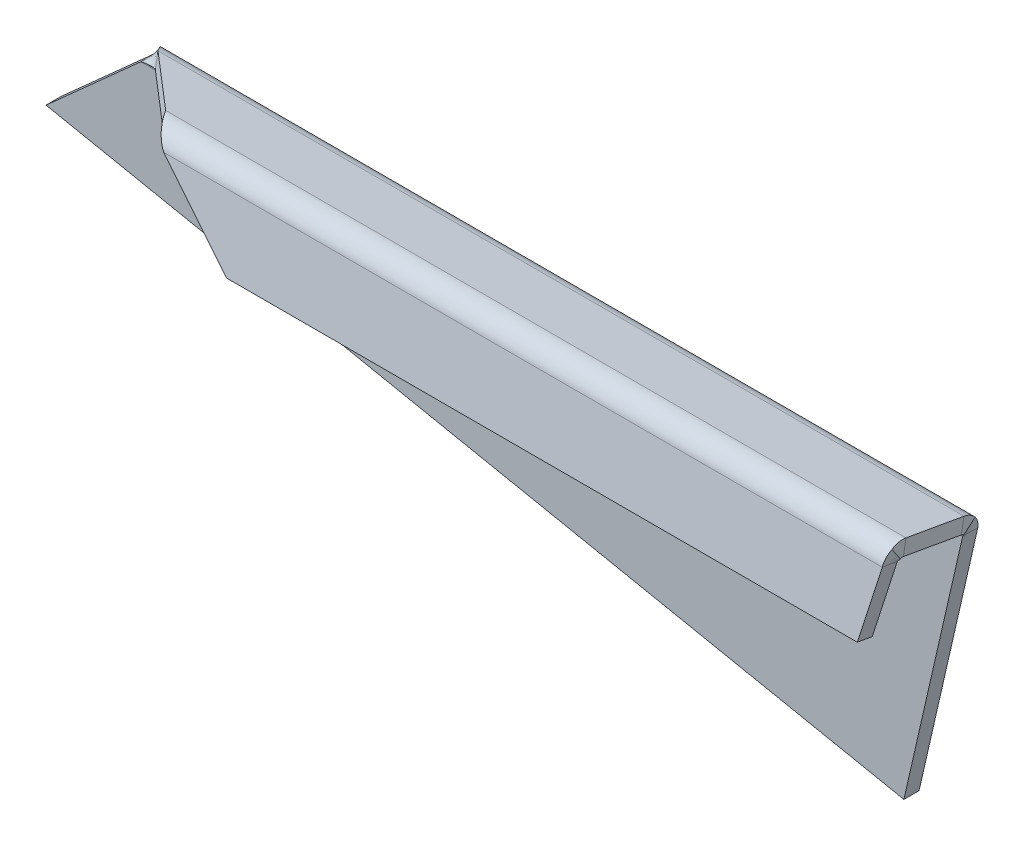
ISO-10303-21;
HEADER;
FILE_DESCRIPTION(('STEP AP214'),'2;1');
FILE_NAME('part.step','',(''),(''),'','','');
FILE_SCHEMA(('AUTOMOTIVE_DESIGN { 1 0 10303 214 1 1 1 1 }'));
ENDSEC;
DATA;
#1=APPLICATION_CONTEXT('core data for automotive mechanical design processes');
#2=APPLICATION_PROTOCOL_DEFINITION('international standard','automotive_design',2000,#1);
#3=PRODUCT_CONTEXT('',#1,'mechanical');
#4=PRODUCT('Part','Part','',(#3));
#5=PRODUCT_RELATED_PRODUCT_CATEGORY('part','',(#4));
#6=PRODUCT_DEFINITION_FORMATION('','',#4);
#7=PRODUCT_DEFINITION_CONTEXT('part definition',#1,'design');
#8=PRODUCT_DEFINITION('design','',#6,#7);
#9=PRODUCT_DEFINITION_SHAPE('','',#8);
#10=(LENGTH_UNIT() NAMED_UNIT(*) SI_UNIT(.MILLI.,.METRE.));
#11=(NAMED_UNIT(*) PLANE_ANGLE_UNIT() SI_UNIT($,.RADIAN.));
#12=(NAMED_UNIT(*) SI_UNIT($,.STERADIAN.) SOLID_ANGLE_UNIT());
#13=UNCERTAINTY_MEASURE_WITH_UNIT(LENGTH_MEASURE(1.E-05),#10,'distance_accuracy_value','');
#14=(GEOMETRIC_REPRESENTATION_CONTEXT(3) GLOBAL_UNCERTAINTY_ASSIGNED_CONTEXT((#13)) GLOBAL_UNIT_ASSIGNED_CONTEXT((#10,
#11,#12)) REPRESENTATION_CONTEXT('',''));
#15=CARTESIAN_POINT('',(0.,0.,0.));
#16=DIRECTION('',(0.,0.,1.));
#17=DIRECTION('',(1.,0.,0.));
#18=AXIS2_PLACEMENT_3D('',#15,#16,#17);
#19=CARTESIAN_POINT('',(0.,18.8237657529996,82.9229853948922));
#20=DIRECTION('',(0.,0.984807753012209,-0.173648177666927));
#21=DIRECTION('',(-1.,0.,0.));
#22=AXIS2_PLACEMENT_3D('',#19,#20,#21);
#23=PLANE('',#22);
#24=DIRECTION('',(-0.744835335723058,-0.115866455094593,-0.657111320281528));
#25=VECTOR('',#24,1.);
#26=CARTESIAN_POINT('',(-485.,-3.57684916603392,-44.1172147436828));
#27=LINE('',#26,#25);
#28=CARTESIAN_POINT('',(-390.911503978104,11.0595408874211,38.8898780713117));
#29=VERTEX_POINT('',#28);
#30=CARTESIAN_POINT('',(-425.626466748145,5.65928732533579,8.26351822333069));
#31=VERTEX_POINT('',#30);
#32=EDGE_CURVE('E94',#29,#31,#27,.T.);
#33=ORIENTED_EDGE('',*,*,#32,.F.);
#34=DIRECTION('',(1.,0.,0.));
#35=VECTOR('',#34,1.);
#36=CARTESIAN_POINT('',(0.,11.059540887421,38.8898780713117));
#37=LINE('',#36,#35);
#38=CARTESIAN_POINT('',(0.,11.059540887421,38.8898780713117));
#39=VERTEX_POINT('',#38);
#40=EDGE_CURVE('E87',#29,#39,#37,.T.);
#41=ORIENTED_EDGE('',*,*,#40,.T.);
#42=DIRECTION('',(0.,0.173648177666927,0.984807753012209));
#43=VECTOR('',#42,1.);
#44=CARTESIAN_POINT('',(0.,4.93191153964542,4.13836515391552));
#45=LINE('',#44,#43);
#46=CARTESIAN_POINT('',(0.,5.65928732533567,8.2635182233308));
#47=VERTEX_POINT('',#46);
#48=EDGE_CURVE('E102',#47,#39,#45,.T.);
#49=ORIENTED_EDGE('',*,*,#48,.F.);
#50=DIRECTION('',(1.,0.,0.));
#51=VECTOR('',#50,1.);
#52=CARTESIAN_POINT('',(0.,5.65928732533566,8.26351822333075));
#53=LINE('',#52,#51);
#54=EDGE_CURVE('E568',#31,#47,#53,.T.);
#55=ORIENTED_EDGE('',*,*,#54,.F.);
#56=EDGE_LOOP('',(#33,#41,#49,#55));
#57=FACE_BOUND('',#56,.T.);
#58=ADVANCED_FACE('F75',(#57),#23,.T.);
#59=CARTESIAN_POINT('',(0.,10.9453037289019,84.3121708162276));
#60=DIRECTION('',(0.,0.984807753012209,-0.173648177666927));
#61=DIRECTION('',(-1.,0.,0.));
#62=AXIS2_PLACEMENT_3D('',#59,#60,#61);
#63=PLANE('',#62);
#64=DIRECTION('',(1.,0.,0.));
#65=VECTOR('',#64,1.);
#66=CARTESIAN_POINT('',(0.,3.18107886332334,40.2790634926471));
#67=LINE('',#66,#65);
#68=CARTESIAN_POINT('',(-390.911503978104,3.18107886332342,40.2790634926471));
#69=VERTEX_POINT('',#68);
#70=CARTESIAN_POINT('',(0.,3.18107886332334,40.2790634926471));
#71=VERTEX_POINT('',#70);
#72=EDGE_CURVE('E386',#69,#71,#67,.T.);
#73=ORIENTED_EDGE('',*,*,#72,.F.);
#74=DIRECTION('',(-0.744835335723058,-0.115866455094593,-0.657111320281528));
#75=VECTOR('',#74,1.);
#76=CARTESIAN_POINT('',(-485.,-11.4553111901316,-42.7280293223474));
#77=LINE('',#76,#75);
#78=CARTESIAN_POINT('',(-425.626466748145,-2.21917469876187,9.65270364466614));
#79=VERTEX_POINT('',#78);
#80=EDGE_CURVE('E572',#69,#79,#77,.T.);
#81=ORIENTED_EDGE('',*,*,#80,.T.);
#82=DIRECTION('',(1.,0.,0.));
#83=VECTOR('',#82,1.);
#84=CARTESIAN_POINT('',(0.,-2.21917469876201,9.65270364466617));
#85=LINE('',#84,#83);
#86=CARTESIAN_POINT('',(0.,-2.21917469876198,9.65270364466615));
#87=VERTEX_POINT('',#86);
#88=EDGE_CURVE('E569',#79,#87,#85,.T.);
#89=ORIENTED_EDGE('',*,*,#88,.T.);
#90=DIRECTION('',(0.,0.173648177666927,0.984807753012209));
#91=VECTOR('',#90,1.);
#92=CARTESIAN_POINT('',(0.,-2.94655048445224,5.52755057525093));
#93=LINE('',#92,#91);
#94=EDGE_CURVE('E590',#87,#71,#93,.T.);
#95=ORIENTED_EDGE('',*,*,#94,.T.);
#96=EDGE_LOOP('',(#73,#81,#89,#95));
#97=FACE_BOUND('',#96,.T.);
#98=ADVANCED_FACE('F643',(#97),#63,.F.);
#99=CARTESIAN_POINT('',(-485.,-11.4553111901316,-42.7280293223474));
#100=DIRECTION('',(0.66724832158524,-0.129339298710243,-0.733519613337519));
#101=DIRECTION('',(0.744835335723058,0.115866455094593,0.657111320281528));
#102=AXIS2_PLACEMENT_3D('',#99,#100,#101);
#103=PLANE('',#102);
#104=CARTESIAN_POINT('',(-390.911503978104,11.0595408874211,38.8898780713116));
#105=CARTESIAN_POINT('',(-390.911503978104,3.18107886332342,40.2790634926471));
#106=B_SPLINE_CURVE_WITH_KNOTS('',1,(#104,#105),.UNSPECIFIED.,.F.,.F.,(2,2),(0.,1.),.UNSPECIFIED.);
#107=EDGE_CURVE('E12',#29,#69,#106,.T.);
#108=ORIENTED_EDGE('',*,*,#107,.F.);
#109=ORIENTED_EDGE('',*,*,#32,.T.);
#110=CARTESIAN_POINT('',(-425.626466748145,-2.21917469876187,9.65270364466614));
#111=CARTESIAN_POINT('',(-425.626466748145,5.65928732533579,8.26351822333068));
#112=B_SPLINE_CURVE_WITH_KNOTS('',1,(#110,#111),.UNSPECIFIED.,.F.,.F.,(2,2),(0.,1.),.UNSPECIFIED.);
#113=EDGE_CURVE('E440',#31,#79,#112,.F.);
#114=ORIENTED_EDGE('',*,*,#113,.T.);
#115=ORIENTED_EDGE('',*,*,#80,.F.);
#116=EDGE_LOOP('',(#108,#109,#114,#115));
#117=FACE_BOUND('',#116,.T.);
#118=ADVANCED_FACE('F77',(#117),#103,.F.);
#119=CARTESIAN_POINT('',(0.,-2.94655048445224,5.52755057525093));
#120=DIRECTION('',(-1.,0.,0.));
#121=DIRECTION('',(0.,-0.984807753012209,0.173648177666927));
#122=AXIS2_PLACEMENT_3D('',#119,#120,#121);
#123=PLANE('',#122);
#124=DIRECTION('',(0.,0.984807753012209,-0.173648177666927));
#125=VECTOR('',#124,1.);
#126=CARTESIAN_POINT('',(0.,3.18107886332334,40.2790634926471));
#127=LINE('',#126,#125);
#128=EDGE_CURVE('E599',#71,#39,#127,.T.);
#129=ORIENTED_EDGE('',*,*,#128,.F.);
#130=ORIENTED_EDGE('',*,*,#94,.F.);
#131=DIRECTION('',(0.,0.984807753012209,-0.173648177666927));
#132=VECTOR('',#131,1.);
#133=CARTESIAN_POINT('',(0.,-2.21917469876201,9.65270364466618));
#134=LINE('',#133,#132);
#135=EDGE_CURVE('E566',#87,#47,#134,.T.);
#136=ORIENTED_EDGE('',*,*,#135,.T.);
#137=ORIENTED_EDGE('',*,*,#48,.T.);
#138=EDGE_LOOP('',(#129,#130,#136,#137));
#139=FACE_BOUND('',#138,.T.);
#140=ADVANCED_FACE('F548',(#139),#123,.F.);
#141=CARTESIAN_POINT('',(-485.,-49.,8.));
#142=DIRECTION('',(0.19694847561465,0.980413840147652,0.));
#143=DIRECTION('',(-0.980413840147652,0.19694847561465,0.));
#144=AXIS2_PLACEMENT_3D('',#141,#142,#143);
#145=PLANE('',#144);
#146=DIRECTION('',(0.980413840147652,-0.19694847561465,0.));
#147=VECTOR('',#146,1.);
#148=CARTESIAN_POINT('',(-485.,-49.,0.));
#149=LINE('',#148,#147);
#150=CARTESIAN_POINT('',(-485.,-49.,0.));
#151=VERTEX_POINT('',#150);
#152=CARTESIAN_POINT('',(-32.,-140.,0.));
#153=VERTEX_POINT('',#152);
#154=EDGE_CURVE('E512',#151,#153,#149,.T.);
#155=ORIENTED_EDGE('',*,*,#154,.T.);
#156=DIRECTION('',(0.,0.,-1.));
#157=VECTOR('',#156,1.);
#158=CARTESIAN_POINT('',(-32.,-140.,8.));
#159=LINE('',#158,#157);
#160=CARTESIAN_POINT('',(-32.,-140.,8.));
#161=VERTEX_POINT('',#160);
#162=EDGE_CURVE('E495',#161,#153,#159,.T.);
#163=ORIENTED_EDGE('',*,*,#162,.F.);
#164=DIRECTION('',(0.980413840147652,-0.19694847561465,0.));
#165=VECTOR('',#164,1.);
#166=CARTESIAN_POINT('',(-485.,-49.,8.));
#167=LINE('',#166,#165);
#168=CARTESIAN_POINT('',(-485.,-49.,8.));
#169=VERTEX_POINT('',#168);
#170=EDGE_CURVE('E505',#169,#161,#167,.T.);
#171=ORIENTED_EDGE('',*,*,#170,.F.);
#172=DIRECTION('',(0.,0.,-1.));
#173=VECTOR('',#172,1.);
#174=CARTESIAN_POINT('',(-485.,-49.,8.));
#175=LINE('',#174,#173);
#176=EDGE_CURVE('E509',#169,#151,#175,.T.);
#177=ORIENTED_EDGE('',*,*,#176,.T.);
#178=EDGE_LOOP('',(#155,#163,#171,#177));
#179=FACE_BOUND('',#178,.T.);
#180=ADVANCED_FACE('F472',(#179),#145,.F.);
#181=CARTESIAN_POINT('',(0.,80.,8.));
#182=DIRECTION('',(0.,0.,-1.));
#183=DIRECTION('',(-1.,0.,0.));
#184=AXIS2_PLACEMENT_3D('',#181,#182,#183);
#185=PLANE('',#184);
#186=DIRECTION('',(1.,0.,0.));
#187=VECTOR('',#186,1.);
#188=CARTESIAN_POINT('',(0.,-4.18879020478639,8.));
#189=LINE('',#188,#187);
#190=CARTESIAN_POINT('',(-434.978184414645,-4.18879020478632,8.));
#191=VERTEX_POINT('',#190);
#192=CARTESIAN_POINT('',(-0.957437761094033,-4.18879020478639,8.));
#193=VERTEX_POINT('',#192);
#194=EDGE_CURVE('E517',#191,#193,#189,.T.);
#195=ORIENTED_EDGE('',*,*,#194,.F.);
#196=DIRECTION('',(-0.744835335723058,-0.66724832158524,0.));
#197=VECTOR('',#196,1.);
#198=CARTESIAN_POINT('',(-485.,-49.,8.));
#199=LINE('',#198,#197);
#200=EDGE_CURVE('E508',#191,#169,#199,.T.);
#201=ORIENTED_EDGE('',*,*,#200,.T.);
#202=ORIENTED_EDGE('',*,*,#170,.T.);
#203=DIRECTION('',(0.222824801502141,0.974858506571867,0.));
#204=VECTOR('',#203,1.);
#205=CARTESIAN_POINT('',(0.,0.,8.));
#206=LINE('',#205,#204);
#207=EDGE_CURVE('E507',#161,#193,#206,.T.);
#208=ORIENTED_EDGE('',*,*,#207,.T.);
#209=EDGE_LOOP('',(#195,#201,#202,#208));
#210=FACE_BOUND('',#209,.T.);
#211=ADVANCED_FACE('F540',(#210),#185,.F.);
#212=CARTESIAN_POINT('',(-485.,-49.,8.));
#213=DIRECTION('',(0.66724832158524,-0.744835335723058,0.));
#214=DIRECTION('',(0.744835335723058,0.66724832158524,0.));
#215=AXIS2_PLACEMENT_3D('',#212,#213,#214);
#216=PLANE('',#215);
#217=CARTESIAN_POINT('',(-434.978184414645,-4.18879020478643,0.));
#218=CARTESIAN_POINT('',(-434.978184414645,-4.18879020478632,8.));
#219=B_SPLINE_CURVE_WITH_KNOTS('',1,(#217,#218),.UNSPECIFIED.,.F.,.F.,(2,2),(0.,1.),.UNSPECIFIED.);
#220=CARTESIAN_POINT('',(-434.978184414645,-4.1887902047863,0.));
#221=VERTEX_POINT('',#220);
#222=EDGE_CURVE('E437',#221,#191,#219,.T.);
#223=ORIENTED_EDGE('',*,*,#222,.F.);
#224=DIRECTION('',(-0.744835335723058,-0.66724832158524,0.));
#225=VECTOR('',#224,1.);
#226=CARTESIAN_POINT('',(-485.,-49.,0.));
#227=LINE('',#226,#225);
#228=EDGE_CURVE('E563',#221,#151,#227,.T.);
#229=ORIENTED_EDGE('',*,*,#228,.T.);
#230=ORIENTED_EDGE('',*,*,#176,.F.);
#231=ORIENTED_EDGE('',*,*,#200,.F.);
#232=EDGE_LOOP('',(#223,#229,#230,#231));
#233=FACE_BOUND('',#232,.T.);
#234=ADVANCED_FACE('F530',(#233),#216,.F.);
#235=CARTESIAN_POINT('',(0.,80.,0.));
#236=DIRECTION('',(0.,0.,-1.));
#237=DIRECTION('',(-1.,0.,0.));
#238=AXIS2_PLACEMENT_3D('',#235,#236,#237);
#239=PLANE('',#238);
#240=ORIENTED_EDGE('',*,*,#228,.F.);
#241=DIRECTION('',(1.,0.,0.));
#242=VECTOR('',#241,1.);
#243=CARTESIAN_POINT('',(0.,-4.18879020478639,0.));
#244=LINE('',#243,#242);
#245=CARTESIAN_POINT('',(-0.957437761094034,-4.1887902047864,0.));
#246=VERTEX_POINT('',#245);
#247=EDGE_CURVE('E504',#221,#246,#244,.T.);
#248=ORIENTED_EDGE('',*,*,#247,.T.);
#249=DIRECTION('',(0.222824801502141,0.974858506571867,0.));
#250=VECTOR('',#249,1.);
#251=CARTESIAN_POINT('',(0.,0.,0.));
#252=LINE('',#251,#250);
#253=EDGE_CURVE('E503',#153,#246,#252,.T.);
#254=ORIENTED_EDGE('',*,*,#253,.F.);
#255=ORIENTED_EDGE('',*,*,#154,.F.);
#256=EDGE_LOOP('',(#240,#248,#254,#255));
#257=FACE_BOUND('',#256,.T.);
#258=ADVANCED_FACE('F539',(#257),#239,.T.);
#259=CARTESIAN_POINT('',(0.,0.,8.));
#260=DIRECTION('',(-0.974858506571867,0.222824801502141,0.));
#261=DIRECTION('',(-0.222824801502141,-0.974858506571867,0.));
#262=AXIS2_PLACEMENT_3D('',#259,#260,#261);
#263=PLANE('',#262);
#264=CARTESIAN_POINT('',(-0.957437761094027,-4.18879020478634,8.));
#265=CARTESIAN_POINT('',(-0.957437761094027,-4.18879020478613,0.));
#266=B_SPLINE_CURVE_WITH_KNOTS('',1,(#264,#265),.UNSPECIFIED.,.F.,.F.,(2,2),(0.,1.),.UNSPECIFIED.);
#267=EDGE_CURVE('E519',#193,#246,#266,.T.);
#268=ORIENTED_EDGE('',*,*,#267,.F.);
#269=ORIENTED_EDGE('',*,*,#207,.F.);
#270=ORIENTED_EDGE('',*,*,#162,.T.);
#271=ORIENTED_EDGE('',*,*,#253,.T.);
#272=EDGE_LOOP('',(#268,#269,#270,#271));
#273=FACE_BOUND('',#272,.T.);
#274=ADVANCED_FACE('F467',(#273),#263,.F.);
#275=CARTESIAN_POINT('',(-425.626466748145,5.65928732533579,8.26351822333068));
#276=CARTESIAN_POINT('',(-426.405837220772,5.45722276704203,7.1175531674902));
#277=CARTESIAN_POINT('',(-427.185086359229,5.05324025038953,6.00766631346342));
#278=CARTESIAN_POINT('',(-428.743705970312,3.88968741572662,3.9923336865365));
#279=CARTESIAN_POINT('',(-429.523015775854,3.1304190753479,3.08747291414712));
#280=CARTESIAN_POINT('',(-431.081635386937,1.34775270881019,1.59163822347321));
#281=CARTESIAN_POINT('',(-431.860945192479,0.324793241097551,1.00103229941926));
#282=CARTESIAN_POINT('',(-433.419564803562,-1.86197078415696,0.205115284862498));
#283=CARTESIAN_POINT('',(-434.198813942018,-3.02514679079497,0.));
#284=CARTESIAN_POINT('',(-434.978184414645,-4.18879020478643,0.));
#285=CARTESIAN_POINT('',(-425.626466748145,-2.21917469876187,9.65270364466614));
#286=CARTESIAN_POINT('',(-426.405783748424,-2.25958483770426,9.42352635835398));
#287=CARTESIAN_POINT('',(-427.185086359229,-2.34038411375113,9.20153326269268));
#288=CARTESIAN_POINT('',(-428.743705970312,-2.57309468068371,8.7984667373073));
#289=CARTESIAN_POINT('',(-429.523015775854,-2.72494834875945,8.61749458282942));
#290=CARTESIAN_POINT('',(-431.081635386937,-3.08148162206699,8.31832764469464));
#291=CARTESIAN_POINT('',(-431.860945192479,-3.28607351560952,8.20020645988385));
#292=CARTESIAN_POINT('',(-433.419564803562,-3.72342632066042,8.0410230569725));
#293=CARTESIAN_POINT('',(-434.198867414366,-3.9560774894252,8.));
#294=CARTESIAN_POINT('',(-434.978184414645,-4.18879020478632,8.));
#295=B_SPLINE_SURFACE_WITH_KNOTS('',1,3,((#275,#276,#277,#278,#279,#280,#281,#282,#283,#284),
(#285,#286,#287,#288,#289,#290,#291,#292,#293,#294)),.UNSPECIFIED.,.F.,.F.,.F.,(2,2),(4,2,2,2,
4),(0.,1.),(0.,0.25,0.5,0.75,1.),.UNSPECIFIED.);
#296=CARTESIAN_POINT('',(-425.626466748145,5.65928732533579,8.26351822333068));
#297=CARTESIAN_POINT('',(-426.405837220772,5.45722276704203,7.1175531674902));
#298=CARTESIAN_POINT('',(-427.185086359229,5.05324025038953,6.00766631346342));
#299=CARTESIAN_POINT('',(-428.743705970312,3.88968741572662,3.9923336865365));
#300=CARTESIAN_POINT('',(-429.523015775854,3.1304190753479,3.08747291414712));
#301=CARTESIAN_POINT('',(-431.081635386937,1.34775270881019,1.59163822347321));
#302=CARTESIAN_POINT('',(-431.860945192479,0.324793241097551,1.00103229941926));
#303=CARTESIAN_POINT('',(-433.419564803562,-1.86197078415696,0.205115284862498));
#304=CARTESIAN_POINT('',(-434.198813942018,-3.02514679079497,0.));
#305=CARTESIAN_POINT('',(-434.978184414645,-4.18879020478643,0.));
#306=B_SPLINE_CURVE_WITH_KNOTS('',3,(#296,#297,#298,#299,#300,#301,#302,#303,#304,#305),
.UNSPECIFIED.,.F.,.F.,(4,2,2,2,4),(0.,0.25,0.5,0.75,1.),.UNSPECIFIED.);
#307=EDGE_CURVE('E383',#31,#221,#306,.T.);
#308=CARTESIAN_POINT('',(-434.978184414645,-4.18879020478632,8.));
#309=CARTESIAN_POINT('',(-434.198867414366,-3.9560774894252,8.));
#310=CARTESIAN_POINT('',(-433.419564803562,-3.72342632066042,8.0410230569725));
#311=CARTESIAN_POINT('',(-431.860945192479,-3.28607351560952,8.20020645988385));
#312=CARTESIAN_POINT('',(-431.081635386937,-3.08148162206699,8.31832764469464));
#313=CARTESIAN_POINT('',(-429.523015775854,-2.72494834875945,8.61749458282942));
#314=CARTESIAN_POINT('',(-428.743705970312,-2.57309468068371,8.7984667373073));
#315=CARTESIAN_POINT('',(-427.185086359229,-2.34038411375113,9.20153326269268));
#316=CARTESIAN_POINT('',(-426.405783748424,-2.25958483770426,9.42352635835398));
#317=CARTESIAN_POINT('',(-425.626466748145,-2.21917469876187,9.65270364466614));
#318=B_SPLINE_CURVE_WITH_KNOTS('',3,(#308,#309,#310,#311,#312,#313,#314,#315,#316,#317),
.UNSPECIFIED.,.F.,.F.,(4,2,2,2,4),(0.,0.25,0.5,0.75,1.),.UNSPECIFIED.);
#319=EDGE_CURVE('E412',#79,#191,#318,.F.);
#320=ORIENTED_EDGE('',*,*,#113,.F.);
#321=ORIENTED_EDGE('',*,*,#307,.T.);
#322=ORIENTED_EDGE('',*,*,#222,.T.);
#323=ORIENTED_EDGE('',*,*,#319,.F.);
#324=EDGE_LOOP('',(#320,#321,#322,#323));
#325=FACE_BOUND('',#324,.T.);
#326=ADVANCED_FACE('F435',(#325),#295,.F.);
#327=CARTESIAN_POINT('',(-0.957437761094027,-4.18879020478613,0.));
#328=CARTESIAN_POINT('',(-0.636978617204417,-1.85210894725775,0.));
#329=CARTESIAN_POINT('',(-0.32045914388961,0.44908419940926,0.837565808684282));
#330=CARTESIAN_POINT('',(0.,2.23908589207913,2.33955556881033));
#331=CARTESIAN_POINT('',(-0.957437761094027,-4.18879020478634,8.));
#332=CARTESIAN_POINT('',(-0.637251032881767,-3.72185122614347,8.00000000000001));
#333=CARTESIAN_POINT('',(-0.320186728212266,-3.26091099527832,8.16776852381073));
#334=CARTESIAN_POINT('',(0.,-2.90321498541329,8.46791111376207));
#335=B_SPLINE_SURFACE_WITH_KNOTS('',1,3,((#327,#328,#329,#330),(#331,#332,#333,#334)),
.UNSPECIFIED.,.F.,.F.,.F.,(2,2),(4,4),(0.,1.),(0.,1.),.UNSPECIFIED.);
#336=CARTESIAN_POINT('',(-0.957437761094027,-4.18879020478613,0.));
#337=CARTESIAN_POINT('',(-0.636978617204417,-1.85210894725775,0.));
#338=CARTESIAN_POINT('',(-0.32045914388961,0.44908419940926,0.837565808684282));
#339=CARTESIAN_POINT('',(0.,2.23908589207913,2.33955556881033));
#340=B_SPLINE_CURVE_WITH_KNOTS('',3,(#336,#337,#338,#339),.UNSPECIFIED.,.F.,.F.,(4,4),(0.,1.),.UNSPECIFIED.);
#341=CARTESIAN_POINT('',(0.,2.23908589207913,2.33955556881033));
#342=VERTEX_POINT('',#341);
#343=EDGE_CURVE('E421',#246,#342,#340,.T.);
#344=CARTESIAN_POINT('',(0.,2.23908589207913,2.33955556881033));
#345=CARTESIAN_POINT('',(0.,-2.90321498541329,8.46791111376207));
#346=B_SPLINE_CURVE_WITH_KNOTS('',1,(#344,#345),.UNSPECIFIED.,.F.,.F.,(2,2),(0.,1.),.UNSPECIFIED.);
#347=CARTESIAN_POINT('',(0.,-2.90321498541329,8.46791111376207));
#348=VERTEX_POINT('',#347);
#349=EDGE_CURVE('E520',#342,#348,#346,.T.);
#350=CARTESIAN_POINT('',(0.,-2.90321498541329,8.46791111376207));
#351=CARTESIAN_POINT('',(-0.320186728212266,-3.26091099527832,8.16776852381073));
#352=CARTESIAN_POINT('',(-0.637251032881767,-3.72185122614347,8.00000000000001));
#353=CARTESIAN_POINT('',(-0.957437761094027,-4.18879020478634,8.));
#354=B_SPLINE_CURVE_WITH_KNOTS('',3,(#350,#351,#352,#353),.UNSPECIFIED.,.F.,.F.,(4,4),(0.,1.),.UNSPECIFIED.);
#355=EDGE_CURVE('E407',#193,#348,#354,.F.);
#356=ORIENTED_EDGE('',*,*,#267,.T.);
#357=ORIENTED_EDGE('',*,*,#343,.T.);
#358=ORIENTED_EDGE('',*,*,#349,.T.);
#359=ORIENTED_EDGE('',*,*,#355,.F.);
#360=EDGE_LOOP('',(#356,#357,#358,#359));
#361=FACE_BOUND('',#360,.T.);
#362=ADVANCED_FACE('F466',(#361),#335,.F.);
#363=CARTESIAN_POINT('',(0.,-4.18879020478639,10.));
#364=DIRECTION('',(-1.,0.,0.));
#365=DIRECTION('',(0.,-1.,0.));
#366=AXIS2_PLACEMENT_3D('',#363,#364,#365);
#367=PLANE('',#366);
#368=ORIENTED_EDGE('',*,*,#349,.F.);
#369=CARTESIAN_POINT('',(0.,-4.18879020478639,10.));
#370=DIRECTION('',(-1.,0.,0.));
#371=DIRECTION('',(0.,-1.,0.));
#372=AXIS2_PLACEMENT_3D('',#369,#370,#371);
#373=CIRCLE('',#372,10.);
#374=EDGE_CURVE('E334',#342,#47,#373,.F.);
#375=ORIENTED_EDGE('',*,*,#374,.T.);
#376=ORIENTED_EDGE('',*,*,#135,.F.);
#377=CARTESIAN_POINT('',(0.,-4.18879020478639,10.));
#378=DIRECTION('',(1.,0.,0.));
#379=DIRECTION('',(0.,1.,0.));
#380=AXIS2_PLACEMENT_3D('',#377,#378,#379);
#381=CIRCLE('',#380,2.);
#382=EDGE_CURVE('E411',#348,#87,#381,.T.);
#383=ORIENTED_EDGE('',*,*,#382,.F.);
#384=EDGE_LOOP('',(#368,#375,#376,#383));
#385=FACE_BOUND('',#384,.T.);
#386=ADVANCED_FACE('F754',(#385),#367,.F.);
#387=CARTESIAN_POINT('',(217.164588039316,-4.18879020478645,10.));
#388=DIRECTION('',(-1.,0.,0.));
#389=DIRECTION('',(0.,-1.,0.));
#390=AXIS2_PLACEMENT_3D('',#387,#388,#389);
#391=CYLINDRICAL_SURFACE('',#390,2.);
#392=ORIENTED_EDGE('',*,*,#382,.T.);
#393=ORIENTED_EDGE('',*,*,#88,.F.);
#394=ORIENTED_EDGE('',*,*,#319,.T.);
#395=ORIENTED_EDGE('',*,*,#194,.T.);
#396=ORIENTED_EDGE('',*,*,#355,.T.);
#397=EDGE_LOOP('',(#392,#393,#394,#395,#396));
#398=FACE_BOUND('',#397,.T.);
#399=ADVANCED_FACE('F292',(#398),#391,.F.);
#400=CARTESIAN_POINT('',(217.164588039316,-4.18879020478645,10.));
#401=DIRECTION('',(-1.,0.,0.));
#402=DIRECTION('',(0.,-1.,0.));
#403=AXIS2_PLACEMENT_3D('',#400,#401,#402);
#404=CYLINDRICAL_SURFACE('',#403,10.);
#405=ORIENTED_EDGE('',*,*,#374,.F.);
#406=ORIENTED_EDGE('',*,*,#343,.F.);
#407=ORIENTED_EDGE('',*,*,#247,.F.);
#408=ORIENTED_EDGE('',*,*,#307,.F.);
#409=ORIENTED_EDGE('',*,*,#54,.T.);
#410=EDGE_LOOP('',(#405,#406,#407,#408,#409));
#411=FACE_BOUND('',#410,.T.);
#412=ADVANCED_FACE('F290',(#411),#404,.T.);
#413=CARTESIAN_POINT('',(-380.390821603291,2.9479451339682,50.474437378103));
#414=CARTESIAN_POINT('',(-381.267654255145,4.23721591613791,50.2471041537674));
#415=CARTESIAN_POINT('',(-382.14426866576,5.4804626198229,49.7635978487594));
#416=CARTESIAN_POINT('',(-383.897715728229,7.68845626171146,48.3569507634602));
#417=CARTESIAN_POINT('',(-384.774439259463,8.65217400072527,47.4343917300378));
#418=CARTESIAN_POINT('',(-386.527886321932,10.1537935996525,45.289856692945));
#419=CARTESIAN_POINT('',(-387.404609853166,10.6911046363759,44.0687244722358));
#420=CARTESIAN_POINT('',(-389.158056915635,11.2577422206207,41.5127875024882));
#421=CARTESIAN_POINT('',(-390.034671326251,11.2868741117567,40.1791488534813));
#422=CARTESIAN_POINT('',(-390.911503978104,11.0595408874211,38.8898780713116));
#423=CARTESIAN_POINT('',(-380.390821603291,1.55875971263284,42.5959753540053));
#424=CARTESIAN_POINT('',(-381.26755807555,1.81658558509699,42.5505136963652));
#425=CARTESIAN_POINT('',(-382.14426866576,2.06526320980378,42.4538074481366));
#426=CARTESIAN_POINT('',(-383.897715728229,2.50686193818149,42.1724780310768));
#427=CARTESIAN_POINT('',(-384.774439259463,2.69960548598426,41.9879662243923));
#428=CARTESIAN_POINT('',(-386.527886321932,2.99992940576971,41.5590592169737));
#429=CARTESIAN_POINT('',(-387.404609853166,3.10739161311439,41.3148327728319));
#430=CARTESIAN_POINT('',(-389.158056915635,3.22071912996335,40.8036453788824));
#431=CARTESIAN_POINT('',(-390.034767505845,3.22654052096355,40.5368893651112));
#432=CARTESIAN_POINT('',(-390.911503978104,3.18107886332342,40.2790634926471));
#433=B_SPLINE_SURFACE_WITH_KNOTS('',1,3,((#413,#414,#415,#416,#417,#418,#419,#420,#421,#422),
(#423,#424,#425,#426,#427,#428,#429,#430,#431,#432)),.UNSPECIFIED.,.F.,.F.,.F.,(2,2),(4,2,2,2,
4),(0.,1.),(0.,0.25,0.5,0.75,1.),.UNSPECIFIED.);
#434=CARTESIAN_POINT('',(-380.390821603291,1.55875971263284,42.5959753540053));
#435=CARTESIAN_POINT('',(-380.390821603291,2.9479451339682,50.474437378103));
#436=B_SPLINE_CURVE_WITH_KNOTS('',1,(#434,#435),.UNSPECIFIED.,.F.,.F.,(2,2),(0.,1.),.UNSPECIFIED.);
#437=CARTESIAN_POINT('',(-380.390821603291,2.94794513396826,50.474437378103));
#438=VERTEX_POINT('',#437);
#439=CARTESIAN_POINT('',(-380.390821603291,1.55875971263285,42.5959753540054));
#440=VERTEX_POINT('',#439);
#441=EDGE_CURVE('E319',#438,#440,#436,.F.);
#442=CARTESIAN_POINT('',(-380.390821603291,2.9479451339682,50.474437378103));
#443=CARTESIAN_POINT('',(-381.267654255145,4.23721591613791,50.2471041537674));
#444=CARTESIAN_POINT('',(-382.14426866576,5.4804626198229,49.7635978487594));
#445=CARTESIAN_POINT('',(-383.897715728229,7.68845626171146,48.3569507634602));
#446=CARTESIAN_POINT('',(-384.774439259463,8.65217400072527,47.4343917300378));
#447=CARTESIAN_POINT('',(-386.527886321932,10.1537935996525,45.289856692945));
#448=CARTESIAN_POINT('',(-387.404609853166,10.6911046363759,44.0687244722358));
#449=CARTESIAN_POINT('',(-389.158056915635,11.2577422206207,41.5127875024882));
#450=CARTESIAN_POINT('',(-390.034671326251,11.2868741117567,40.1791488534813));
#451=CARTESIAN_POINT('',(-390.911503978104,11.0595408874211,38.8898780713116));
#452=B_SPLINE_CURVE_WITH_KNOTS('',3,(#442,#443,#444,#445,#446,#447,#448,#449,#450,#451),
.UNSPECIFIED.,.F.,.F.,(4,2,2,2,4),(0.,0.25,0.5,0.75,1.),.UNSPECIFIED.);
#453=EDGE_CURVE('E260',#438,#29,#452,.T.);
#454=CARTESIAN_POINT('',(-390.911503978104,3.18107886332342,40.2790634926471));
#455=CARTESIAN_POINT('',(-390.034767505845,3.22654052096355,40.5368893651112));
#456=CARTESIAN_POINT('',(-389.158056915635,3.22071912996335,40.8036453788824));
#457=CARTESIAN_POINT('',(-387.404609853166,3.10739161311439,41.3148327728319));
#458=CARTESIAN_POINT('',(-386.527886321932,2.99992940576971,41.5590592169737));
#459=CARTESIAN_POINT('',(-384.774439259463,2.69960548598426,41.9879662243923));
#460=CARTESIAN_POINT('',(-383.897715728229,2.50686193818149,42.1724780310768));
#461=CARTESIAN_POINT('',(-382.14426866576,2.06526320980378,42.4538074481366));
#462=CARTESIAN_POINT('',(-381.26755807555,1.81658558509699,42.5505136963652));
#463=CARTESIAN_POINT('',(-380.390821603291,1.55875971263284,42.5959753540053));
#464=B_SPLINE_CURVE_WITH_KNOTS('',3,(#454,#455,#456,#457,#458,#459,#460,#461,#462,#463),
.UNSPECIFIED.,.F.,.F.,(4,2,2,2,4),(0.,0.25,0.5,0.75,1.),.UNSPECIFIED.);
#465=EDGE_CURVE('E254',#440,#69,#464,.F.);
#466=ORIENTED_EDGE('',*,*,#441,.F.);
#467=ORIENTED_EDGE('',*,*,#453,.T.);
#468=ORIENTED_EDGE('',*,*,#107,.T.);
#469=ORIENTED_EDGE('',*,*,#465,.F.);
#470=EDGE_LOOP('',(#466,#467,#468,#469));
#471=FACE_BOUND('',#470,.T.);
#472=ADVANCED_FACE('F277',(#471),#433,.F.);
#473=CARTESIAN_POINT('',(0.,1.21146335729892,40.626359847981));
#474=DIRECTION('',(-1.,0.,0.));
#475=DIRECTION('',(0.,-1.,0.));
#476=AXIS2_PLACEMENT_3D('',#473,#474,#475);
#477=PLANE('',#476);
#478=ORIENTED_EDGE('',*,*,#128,.T.);
#479=CARTESIAN_POINT('',(0.,1.21146335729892,40.626359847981));
#480=DIRECTION('',(-1.,0.,0.));
#481=DIRECTION('',(0.,-1.,0.));
#482=AXIS2_PLACEMENT_3D('',#479,#480,#481);
#483=CIRCLE('',#482,10.);
#484=CARTESIAN_POINT('',(0.,9.4029838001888,46.3621242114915));
#485=VERTEX_POINT('',#484);
#486=EDGE_CURVE('E382',#39,#485,#483,.F.);
#487=ORIENTED_EDGE('',*,*,#486,.T.);
#488=CARTESIAN_POINT('',(0.,2.8497674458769,41.7735127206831));
#489=CARTESIAN_POINT('',(0.,9.4029838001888,46.3621242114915));
#490=B_SPLINE_CURVE_WITH_KNOTS('',1,(#488,#489),.UNSPECIFIED.,.F.,.F.,(2,2),(0.,1.),.UNSPECIFIED.);
#491=CARTESIAN_POINT('',(0.,2.8497674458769,41.7735127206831));
#492=VERTEX_POINT('',#491);
#493=EDGE_CURVE('E366',#485,#492,#490,.F.);
#494=ORIENTED_EDGE('',*,*,#493,.T.);
#495=CARTESIAN_POINT('',(0.,1.21146335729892,40.626359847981));
#496=DIRECTION('',(1.,0.,0.));
#497=DIRECTION('',(0.,1.,0.));
#498=AXIS2_PLACEMENT_3D('',#495,#496,#497);
#499=CIRCLE('',#498,2.);
#500=EDGE_CURVE('E380',#71,#492,#499,.T.);
#501=ORIENTED_EDGE('',*,*,#500,.F.);
#502=EDGE_LOOP('',(#478,#487,#494,#501));
#503=FACE_BOUND('',#502,.T.);
#504=ADVANCED_FACE('F289',(#503),#477,.F.);
#505=CARTESIAN_POINT('',(0.,9.4029838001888,46.3621242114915));
#506=CARTESIAN_POINT('',(-0.157107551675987,8.65204055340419,47.4345823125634));
#507=CARTESIAN_POINT('',(-0.314159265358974,7.68845626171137,48.3569507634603));
#508=CARTESIAN_POINT('',(-0.62831853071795,5.48046261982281,49.7635978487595));
#509=CARTESIAN_POINT('',(-0.785370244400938,4.23728459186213,50.2470920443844));
#510=CARTESIAN_POINT('',(-0.942477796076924,2.94794513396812,50.4744373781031));
#511=CARTESIAN_POINT('',(0.,2.8497674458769,41.7735127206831));
#512=CARTESIAN_POINT('',(-0.157100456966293,2.69958557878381,41.9879946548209));
#513=CARTESIAN_POINT('',(-0.314159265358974,2.50686193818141,42.1724780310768));
#514=CARTESIAN_POINT('',(-0.628318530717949,2.0652632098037,42.4538074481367));
#515=CARTESIAN_POINT('',(-0.785377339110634,1.81661595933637,42.5505083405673));
#516=CARTESIAN_POINT('',(-0.942477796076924,1.55875971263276,42.5959753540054));
#517=B_SPLINE_SURFACE_WITH_KNOTS('',1,3,((#505,#506,#507,#508,#509,#510),(#511,#512,#513,#514,
#515,#516)),.UNSPECIFIED.,.F.,.F.,.F.,(2,2),(4,2,4),(0.,1.),(0.,0.5,1.),.UNSPECIFIED.);
#518=CARTESIAN_POINT('',(0.,9.4029838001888,46.3621242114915));
#519=CARTESIAN_POINT('',(-0.157107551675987,8.65204055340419,47.4345823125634));
#520=CARTESIAN_POINT('',(-0.314159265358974,7.68845626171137,48.3569507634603));
#521=CARTESIAN_POINT('',(-0.62831853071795,5.48046261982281,49.7635978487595));
#522=CARTESIAN_POINT('',(-0.785370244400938,4.23728459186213,50.2470920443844));
#523=CARTESIAN_POINT('',(-0.942477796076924,2.94794513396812,50.4744373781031));
#524=B_SPLINE_CURVE_WITH_KNOTS('',3,(#518,#519,#520,#521,#522,#523),.UNSPECIFIED.,.F.,.F.,(4,2,
4),(0.,0.5,1.),.UNSPECIFIED.);
#525=CARTESIAN_POINT('',(-0.942477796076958,2.94794513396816,50.4744373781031));
#526=VERTEX_POINT('',#525);
#527=EDGE_CURVE('E392',#485,#526,#524,.T.);
#528=CARTESIAN_POINT('',(-0.942477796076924,2.94794513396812,50.4744373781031));
#529=CARTESIAN_POINT('',(-0.942477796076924,1.55875971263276,42.5959753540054));
#530=B_SPLINE_CURVE_WITH_KNOTS('',1,(#528,#529),.UNSPECIFIED.,.F.,.F.,(2,2),(0.,1.),.UNSPECIFIED.);
#531=CARTESIAN_POINT('',(-0.942477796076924,1.55875971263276,42.5959753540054));
#532=VERTEX_POINT('',#531);
#533=EDGE_CURVE('E188',#532,#526,#530,.F.);
#534=CARTESIAN_POINT('',(-0.942477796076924,1.55875971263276,42.5959753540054));
#535=CARTESIAN_POINT('',(-0.785377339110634,1.81661595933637,42.5505083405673));
#536=CARTESIAN_POINT('',(-0.628318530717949,2.0652632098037,42.4538074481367));
#537=CARTESIAN_POINT('',(-0.314159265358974,2.50686193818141,42.1724780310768));
#538=CARTESIAN_POINT('',(-0.157100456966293,2.69958557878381,41.9879946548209));
#539=CARTESIAN_POINT('',(0.,2.8497674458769,41.7735127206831));
#540=B_SPLINE_CURVE_WITH_KNOTS('',3,(#534,#535,#536,#537,#538,#539),.UNSPECIFIED.,.F.,.F.,(4,2,
4),(0.,0.5,1.),.UNSPECIFIED.);
#541=EDGE_CURVE('E384',#492,#532,#540,.F.);
#542=ORIENTED_EDGE('',*,*,#493,.F.);
#543=ORIENTED_EDGE('',*,*,#527,.T.);
#544=ORIENTED_EDGE('',*,*,#533,.F.);
#545=ORIENTED_EDGE('',*,*,#541,.F.);
#546=EDGE_LOOP('',(#542,#543,#544,#545));
#547=FACE_BOUND('',#546,.T.);
#548=ADVANCED_FACE('F228',(#547),#517,.F.);
#549=CARTESIAN_POINT('',(195.717107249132,1.21146335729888,40.626359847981));
#550=DIRECTION('',(-1.,0.,0.));
#551=DIRECTION('',(0.,-1.,0.));
#552=AXIS2_PLACEMENT_3D('',#549,#550,#551);
#553=CYLINDRICAL_SURFACE('',#552,2.);
#554=ORIENTED_EDGE('',*,*,#541,.T.);
#555=DIRECTION('',(1.,0.,0.));
#556=VECTOR('',#555,1.);
#557=CARTESIAN_POINT('',(0.,1.55875971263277,42.5959753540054));
#558=LINE('',#557,#556);
#559=EDGE_CURVE('E616',#440,#532,#558,.T.);
#560=ORIENTED_EDGE('',*,*,#559,.F.);
#561=ORIENTED_EDGE('',*,*,#465,.T.);
#562=ORIENTED_EDGE('',*,*,#72,.T.);
#563=ORIENTED_EDGE('',*,*,#500,.T.);
#564=EDGE_LOOP('',(#554,#560,#561,#562,#563));
#565=FACE_BOUND('',#564,.T.);
#566=ADVANCED_FACE('F218',(#565),#553,.F.);
#567=CARTESIAN_POINT('',(195.717107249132,1.21146335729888,40.626359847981));
#568=DIRECTION('',(-1.,0.,0.));
#569=DIRECTION('',(0.,-1.,0.));
#570=AXIS2_PLACEMENT_3D('',#567,#568,#569);
#571=CYLINDRICAL_SURFACE('',#570,10.);
#572=ORIENTED_EDGE('',*,*,#527,.F.);
#573=ORIENTED_EDGE('',*,*,#486,.F.);
#574=ORIENTED_EDGE('',*,*,#40,.F.);
#575=ORIENTED_EDGE('',*,*,#453,.F.);
#576=DIRECTION('',(1.,0.,0.));
#577=VECTOR('',#576,1.);
#578=CARTESIAN_POINT('',(0.,2.94794513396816,50.4744373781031));
#579=LINE('',#578,#577);
#580=EDGE_CURVE('E206',#438,#526,#579,.T.);
#581=ORIENTED_EDGE('',*,*,#580,.T.);
#582=EDGE_LOOP('',(#572,#573,#574,#575,#581));
#583=FACE_BOUND('',#582,.T.);
#584=ADVANCED_FACE('F227',(#583),#571,.T.);
#585=CARTESIAN_POINT('',(-341.,-33.1927532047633,48.7236047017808));
#586=DIRECTION('',(0.,0.984807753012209,-0.173648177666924));
#587=DIRECTION('',(1.,0.,0.));
#588=AXIS2_PLACEMENT_3D('',#585,#586,#587);
#589=PLANE('',#588);
#590=DIRECTION('',(-1.,0.,0.));
#591=VECTOR('',#590,1.);
#592=CARTESIAN_POINT('',(-341.,-31.803567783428,56.6020667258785));
#593=LINE('',#592,#591);
#594=CARTESIAN_POINT('',(-8.00000000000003,-31.8035677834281,56.6020667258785));
#595=VERTEX_POINT('',#594);
#596=CARTESIAN_POINT('',(-341.,-31.803567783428,56.6020667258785));
#597=VERTEX_POINT('',#596);
#598=EDGE_CURVE('E199',#595,#597,#593,.T.);
#599=ORIENTED_EDGE('',*,*,#598,.T.);
#600=DIRECTION('',(0.,0.173648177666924,0.984807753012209));
#601=VECTOR('',#600,1.);
#602=CARTESIAN_POINT('',(-341.,-33.1927532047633,48.7236047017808));
#603=LINE('',#602,#601);
#604=CARTESIAN_POINT('',(-341.,-33.1927532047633,48.7236047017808));
#605=VERTEX_POINT('',#604);
#606=EDGE_CURVE('E653',#605,#597,#603,.T.);
#607=ORIENTED_EDGE('',*,*,#606,.F.);
#608=DIRECTION('',(-1.,0.,0.));
#609=VECTOR('',#608,1.);
#610=CARTESIAN_POINT('',(-341.,-33.1927532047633,48.7236047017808));
#611=LINE('',#610,#609);
#612=CARTESIAN_POINT('',(-8.00000000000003,-33.1927532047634,48.7236047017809));
#613=VERTEX_POINT('',#612);
#614=EDGE_CURVE('E201',#613,#605,#611,.T.);
#615=ORIENTED_EDGE('',*,*,#614,.F.);
#616=DIRECTION('',(0.,0.173648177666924,0.984807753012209));
#617=VECTOR('',#616,1.);
#618=CARTESIAN_POINT('',(-8.00000000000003,-33.1927532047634,48.7236047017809));
#619=LINE('',#618,#617);
#620=EDGE_CURVE('E185',#613,#595,#619,.T.);
#621=ORIENTED_EDGE('',*,*,#620,.T.);
#622=EDGE_LOOP('',(#599,#607,#615,#621));
#623=FACE_BOUND('',#622,.T.);
#624=ADVANCED_FACE('F197',(#623),#589,.F.);
#625=CARTESIAN_POINT('',(0.,-33.1927532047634,48.7236047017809));
#626=DIRECTION('',(0.,0.173648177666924,0.984807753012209));
#627=DIRECTION('',(-1.,0.,0.));
#628=AXIS2_PLACEMENT_3D('',#625,#626,#627);
#629=PLANE('',#628);
#630=DIRECTION('',(-0.744835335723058,0.657111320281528,-0.115866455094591));
#631=VECTOR('',#630,1.);
#632=CARTESIAN_POINT('',(-485.,93.8474469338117,26.3229897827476));
#633=LINE('',#632,#631);
#634=EDGE_CURVE('E202',#605,#440,#633,.T.);
#635=ORIENTED_EDGE('',*,*,#634,.T.);
#636=ORIENTED_EDGE('',*,*,#559,.T.);
#637=DIRECTION('',(-0.196116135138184,-0.965683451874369,0.170276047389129));
#638=VECTOR('',#637,1.);
#639=CARTESIAN_POINT('',(0.,6.19955691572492,41.7776775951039));
#640=LINE('',#639,#638);
#641=EDGE_CURVE('E614',#532,#613,#640,.T.);
#642=ORIENTED_EDGE('',*,*,#641,.T.);
#643=ORIENTED_EDGE('',*,*,#614,.T.);
#644=EDGE_LOOP('',(#635,#636,#642,#643));
#645=FACE_BOUND('',#644,.T.);
#646=ADVANCED_FACE('F635',(#645),#629,.F.);
#647=CARTESIAN_POINT('',(0.,6.19955691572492,41.7776775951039));
#648=DIRECTION('',(-0.98058067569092,0.193136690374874,-0.034055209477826));
#649=DIRECTION('',(0.196116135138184,0.965683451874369,-0.170276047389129));
#650=AXIS2_PLACEMENT_3D('',#647,#648,#649);
#651=PLANE('',#650);
#652=ORIENTED_EDGE('',*,*,#641,.F.);
#653=ORIENTED_EDGE('',*,*,#533,.T.);
#654=DIRECTION('',(-0.196116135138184,-0.965683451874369,0.170276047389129));
#655=VECTOR('',#654,1.);
#656=CARTESIAN_POINT('',(0.,7.58874233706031,49.6561396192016));
#657=LINE('',#656,#655);
#658=EDGE_CURVE('E182',#526,#595,#657,.T.);
#659=ORIENTED_EDGE('',*,*,#658,.T.);
#660=ORIENTED_EDGE('',*,*,#620,.F.);
#661=EDGE_LOOP('',(#652,#653,#659,#660));
#662=FACE_BOUND('',#661,.T.);
#663=ADVANCED_FACE('F184',(#662),#651,.F.);
#664=CARTESIAN_POINT('',(0.,-31.8035677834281,56.6020667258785));
#665=DIRECTION('',(0.,0.173648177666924,0.984807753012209));
#666=DIRECTION('',(-1.,0.,0.));
#667=AXIS2_PLACEMENT_3D('',#664,#665,#666);
#668=PLANE('',#667);
#669=ORIENTED_EDGE('',*,*,#580,.F.);
#670=DIRECTION('',(-0.744835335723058,0.657111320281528,-0.115866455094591));
#671=VECTOR('',#670,1.);
#672=CARTESIAN_POINT('',(-485.,95.2366323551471,34.2014518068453));
#673=LINE('',#672,#671);
#674=EDGE_CURVE('E194',#597,#438,#673,.T.);
#675=ORIENTED_EDGE('',*,*,#674,.F.);
#676=ORIENTED_EDGE('',*,*,#598,.F.);
#677=ORIENTED_EDGE('',*,*,#658,.F.);
#678=EDGE_LOOP('',(#669,#675,#676,#677));
#679=FACE_BOUND('',#678,.T.);
#680=ADVANCED_FACE('F205',(#679),#668,.T.);
#681=CARTESIAN_POINT('',(-485.,93.8474469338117,26.3229897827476));
#682=DIRECTION('',(0.66724832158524,0.733519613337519,-0.12933929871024));
#683=DIRECTION('',(0.744835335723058,-0.657111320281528,0.115866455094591));
#684=AXIS2_PLACEMENT_3D('',#681,#682,#683);
#685=PLANE('',#684);
#686=ORIENTED_EDGE('',*,*,#674,.T.);
#687=ORIENTED_EDGE('',*,*,#441,.T.);
#688=ORIENTED_EDGE('',*,*,#634,.F.);
#689=ORIENTED_EDGE('',*,*,#606,.T.);
#690=EDGE_LOOP('',(#686,#687,#688,#689));
#691=FACE_BOUND('',#690,.T.);
#692=ADVANCED_FACE('F230',(#691),#685,.F.);
#693=CLOSED_SHELL('',(#58,#98,#118,#140,#180,#211,#234,#258,#274,#326,#362,#386,#399,#412,#472,
#504,#548,#566,#584,#624,#646,#663,#680,#692));
#694=MANIFOLD_SOLID_BREP('B2',#693);
#695=ADVANCED_BREP_SHAPE_REPRESENTATION('',(#18,#694),#14);
#696=SHAPE_DEFINITION_REPRESENTATION(#9,#695);
ENDSEC;
END-ISO-10303-21;
